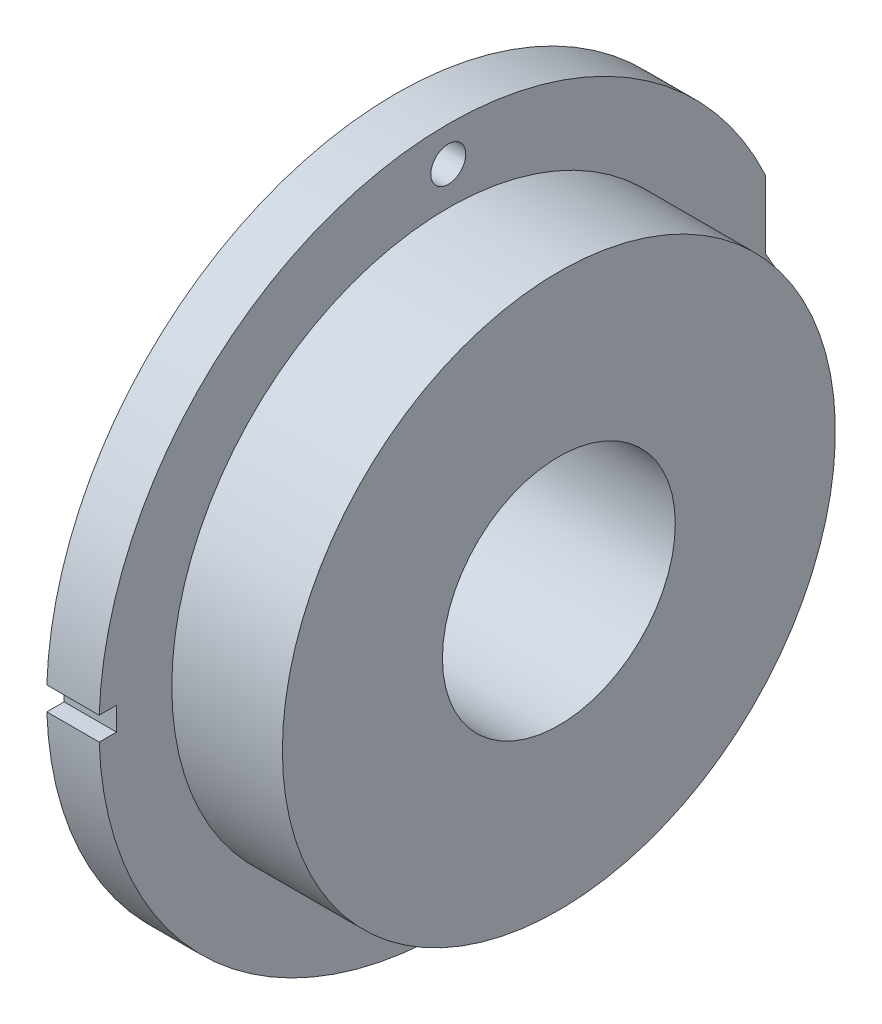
ISO-10303-21;
HEADER;
FILE_DESCRIPTION(('STEP AP214'),'2;1');
FILE_NAME('part.step','',(''),(''),'','','');
FILE_SCHEMA(('AUTOMOTIVE_DESIGN { 1 0 10303 214 1 1 1 1 }'));
ENDSEC;
DATA;
#1=APPLICATION_CONTEXT('core data for automotive mechanical design processes');
#2=APPLICATION_PROTOCOL_DEFINITION('international standard','automotive_design',2000,#1);
#3=PRODUCT_CONTEXT('',#1,'mechanical');
#4=PRODUCT('Part','Part','',(#3));
#5=PRODUCT_RELATED_PRODUCT_CATEGORY('part','',(#4));
#6=PRODUCT_DEFINITION_FORMATION('','',#4);
#7=PRODUCT_DEFINITION_CONTEXT('part definition',#1,'design');
#8=PRODUCT_DEFINITION('design','',#6,#7);
#9=PRODUCT_DEFINITION_SHAPE('','',#8);
#10=(LENGTH_UNIT() NAMED_UNIT(*) SI_UNIT(.MILLI.,.METRE.));
#11=(NAMED_UNIT(*) PLANE_ANGLE_UNIT() SI_UNIT($,.RADIAN.));
#12=(NAMED_UNIT(*) SI_UNIT($,.STERADIAN.) SOLID_ANGLE_UNIT());
#13=UNCERTAINTY_MEASURE_WITH_UNIT(LENGTH_MEASURE(1.E-05),#10,'distance_accuracy_value','');
#14=(GEOMETRIC_REPRESENTATION_CONTEXT(3) GLOBAL_UNCERTAINTY_ASSIGNED_CONTEXT((#13)) GLOBAL_UNIT_ASSIGNED_CONTEXT((#10,
#11,#12)) REPRESENTATION_CONTEXT('',''));
#15=CARTESIAN_POINT('',(0.,0.,0.));
#16=DIRECTION('',(0.,0.,1.));
#17=DIRECTION('',(1.,0.,0.));
#18=AXIS2_PLACEMENT_3D('',#15,#16,#17);
#19=CARTESIAN_POINT('',(-44.2023356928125,0.,0.));
#20=DIRECTION('',(-1.,0.,0.));
#21=DIRECTION('',(0.,0.,1.));
#22=AXIS2_PLACEMENT_3D('',#19,#20,#21);
#23=CYLINDRICAL_SURFACE('',#22,60.);
#24=CARTESIAN_POINT('',(9.,0.,0.));
#25=DIRECTION('',(-1.,0.,0.));
#26=DIRECTION('',(0.,0.,1.));
#27=AXIS2_PLACEMENT_3D('',#24,#25,#26);
#28=CIRCLE('',#27,60.);
#29=CARTESIAN_POINT('',(9.,-25.0948201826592,-54.5));
#30=VERTEX_POINT('',#29);
#31=CARTESIAN_POINT('',(9.,-2.,59.9666574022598));
#32=VERTEX_POINT('',#31);
#33=EDGE_CURVE('E227',#30,#32,#28,.T.);
#34=ORIENTED_EDGE('',*,*,#33,.T.);
#35=DIRECTION('',(-1.,0.,0.));
#36=VECTOR('',#35,1.);
#37=CARTESIAN_POINT('',(-44.2023356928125,-2.,59.9666574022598));
#38=LINE('',#37,#36);
#39=CARTESIAN_POINT('',(0.,-2.,59.9666574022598));
#40=VERTEX_POINT('',#39);
#41=EDGE_CURVE('E137',#32,#40,#38,.T.);
#42=ORIENTED_EDGE('',*,*,#41,.T.);
#43=CARTESIAN_POINT('',(0.,0.,0.));
#44=DIRECTION('',(-1.,0.,0.));
#45=DIRECTION('',(0.,0.,1.));
#46=AXIS2_PLACEMENT_3D('',#43,#44,#45);
#47=CIRCLE('',#46,60.);
#48=CARTESIAN_POINT('',(0.,-25.0948201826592,-54.5));
#49=VERTEX_POINT('',#48);
#50=EDGE_CURVE('E224',#49,#40,#47,.T.);
#51=ORIENTED_EDGE('',*,*,#50,.F.);
#52=DIRECTION('',(-1.,0.,0.));
#53=VECTOR('',#52,1.);
#54=CARTESIAN_POINT('',(28.,-25.0948201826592,-54.5));
#55=LINE('',#54,#53);
#56=EDGE_CURVE('E173',#30,#49,#55,.T.);
#57=ORIENTED_EDGE('',*,*,#56,.F.);
#58=EDGE_LOOP('',(#34,#42,#51,#57));
#59=FACE_BOUND('',#58,.T.);
#60=ADVANCED_FACE('F16',(#59),#23,.T.);
#61=CARTESIAN_POINT('',(-44.2023356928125,0.,0.));
#62=DIRECTION('',(-1.,0.,0.));
#63=DIRECTION('',(0.,0.,1.));
#64=AXIS2_PLACEMENT_3D('',#61,#62,#63);
#65=CYLINDRICAL_SURFACE('',#64,20.);
#66=CARTESIAN_POINT('',(28.,0.,0.));
#67=DIRECTION('',(-1.,0.,0.));
#68=DIRECTION('',(0.,0.,1.));
#69=AXIS2_PLACEMENT_3D('',#66,#67,#68);
#70=CIRCLE('',#69,20.);
#71=CARTESIAN_POINT('',(28.,0.,20.));
#72=VERTEX_POINT('',#71);
#73=EDGE_CURVE('E24',#72,#72,#70,.T.);
#74=ORIENTED_EDGE('',*,*,#73,.F.);
#75=EDGE_LOOP('',(#74));
#76=FACE_BOUND('',#75,.T.);
#77=CARTESIAN_POINT('',(-5.,0.,0.));
#78=DIRECTION('',(-1.,0.,0.));
#79=DIRECTION('',(0.,0.,1.));
#80=AXIS2_PLACEMENT_3D('',#77,#78,#79);
#81=CIRCLE('',#80,20.);
#82=CARTESIAN_POINT('',(-5.,0.,20.));
#83=VERTEX_POINT('',#82);
#84=EDGE_CURVE('E214',#83,#83,#81,.T.);
#85=ORIENTED_EDGE('',*,*,#84,.T.);
#86=EDGE_LOOP('',(#85));
#87=FACE_BOUND('',#86,.T.);
#88=ADVANCED_FACE('F18',(#76,#87),#65,.F.);
#89=CARTESIAN_POINT('',(28.,20.,0.));
#90=DIRECTION('',(-1.,0.,0.));
#91=DIRECTION('',(0.,0.,1.));
#92=AXIS2_PLACEMENT_3D('',#89,#90,#91);
#93=PLANE('',#92);
#94=CARTESIAN_POINT('',(28.,0.,0.));
#95=DIRECTION('',(-1.,0.,0.));
#96=DIRECTION('',(0.,0.,1.));
#97=AXIS2_PLACEMENT_3D('',#94,#95,#96);
#98=CIRCLE('',#97,47.5);
#99=CARTESIAN_POINT('',(28.,0.,47.5));
#100=VERTEX_POINT('',#99);
#101=EDGE_CURVE('E233',#100,#100,#98,.T.);
#102=ORIENTED_EDGE('',*,*,#101,.F.);
#103=EDGE_LOOP('',(#102));
#104=FACE_BOUND('',#103,.T.);
#105=ORIENTED_EDGE('',*,*,#73,.T.);
#106=EDGE_LOOP('',(#105));
#107=FACE_BOUND('',#106,.T.);
#108=ADVANCED_FACE('F238',(#104,#107),#93,.F.);
#109=CARTESIAN_POINT('',(-44.2023356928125,0.,0.));
#110=DIRECTION('',(-1.,0.,0.));
#111=DIRECTION('',(0.,0.,1.));
#112=AXIS2_PLACEMENT_3D('',#109,#110,#111);
#113=CYLINDRICAL_SURFACE('',#112,47.5);
#114=CARTESIAN_POINT('',(9.,0.,0.));
#115=DIRECTION('',(-1.,0.,0.));
#116=DIRECTION('',(0.,0.,1.));
#117=AXIS2_PLACEMENT_3D('',#114,#115,#116);
#118=CIRCLE('',#117,47.5);
#119=CARTESIAN_POINT('',(9.,0.,47.5));
#120=VERTEX_POINT('',#119);
#121=EDGE_CURVE('E230',#120,#120,#118,.T.);
#122=ORIENTED_EDGE('',*,*,#121,.F.);
#123=EDGE_LOOP('',(#122));
#124=FACE_BOUND('',#123,.T.);
#125=ORIENTED_EDGE('',*,*,#101,.T.);
#126=EDGE_LOOP('',(#125));
#127=FACE_BOUND('',#126,.T.);
#128=ADVANCED_FACE('F278',(#124,#127),#113,.T.);
#129=CARTESIAN_POINT('',(9.,47.5,0.));
#130=DIRECTION('',(-1.,0.,0.));
#131=DIRECTION('',(0.,0.,1.));
#132=AXIS2_PLACEMENT_3D('',#129,#130,#131);
#133=PLANE('',#132);
#134=DIRECTION('',(0.,-1.,0.));
#135=VECTOR('',#134,1.);
#136=CARTESIAN_POINT('',(9.,47.5,57.));
#137=LINE('',#136,#135);
#138=CARTESIAN_POINT('',(9.,2.,57.));
#139=VERTEX_POINT('',#138);
#140=CARTESIAN_POINT('',(9.,-2.,57.));
#141=VERTEX_POINT('',#140);
#142=EDGE_CURVE('E119',#139,#141,#137,.T.);
#143=ORIENTED_EDGE('',*,*,#142,.T.);
#144=DIRECTION('',(0.,0.,1.));
#145=VECTOR('',#144,1.);
#146=CARTESIAN_POINT('',(9.,-2.,0.));
#147=LINE('',#146,#145);
#148=EDGE_CURVE('E140',#141,#32,#147,.T.);
#149=ORIENTED_EDGE('',*,*,#148,.T.);
#150=ORIENTED_EDGE('',*,*,#33,.F.);
#151=DIRECTION('',(0.,1.,0.));
#152=VECTOR('',#151,1.);
#153=CARTESIAN_POINT('',(9.,47.5,-54.5));
#154=LINE('',#153,#152);
#155=CARTESIAN_POINT('',(9.,-13.4102540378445,-54.5));
#156=VERTEX_POINT('',#155);
#157=EDGE_CURVE('E196',#30,#156,#154,.T.);
#158=ORIENTED_EDGE('',*,*,#157,.T.);
#159=DIRECTION('',(0.,0.866025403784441,-0.5));
#160=VECTOR('',#159,1.);
#161=CARTESIAN_POINT('',(9.,8.6732442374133,-67.2499136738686));
#162=LINE('',#161,#160);
#163=CARTESIAN_POINT('',(9.,-4.75,-59.5));
#164=VERTEX_POINT('',#163);
#165=EDGE_CURVE('E199',#156,#164,#162,.T.);
#166=ORIENTED_EDGE('',*,*,#165,.T.);
#167=DIRECTION('',(0.,1.,0.));
#168=VECTOR('',#167,1.);
#169=CARTESIAN_POINT('',(9.,47.5,-59.5));
#170=LINE('',#169,#168);
#171=CARTESIAN_POINT('',(9.,-3.75,-59.5));
#172=VERTEX_POINT('',#171);
#173=EDGE_CURVE('E202',#164,#172,#170,.T.);
#174=ORIENTED_EDGE('',*,*,#173,.T.);
#175=DIRECTION('',(0.,0.86602540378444,0.5));
#176=VECTOR('',#175,1.);
#177=CARTESIAN_POINT('',(9.,60.4517557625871,-22.433099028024));
#178=LINE('',#177,#176);
#179=CARTESIAN_POINT('',(9.,0.,-57.3349364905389));
#180=VERTEX_POINT('',#179);
#181=EDGE_CURVE('E205',#172,#180,#178,.T.);
#182=ORIENTED_EDGE('',*,*,#181,.T.);
#183=DIRECTION('',(0.,0.866025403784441,-0.5));
#184=VECTOR('',#183,1.);
#185=CARTESIAN_POINT('',(9.,10.7982442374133,-63.5693057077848));
#186=LINE('',#185,#184);
#187=CARTESIAN_POINT('',(9.,3.75,-59.5));
#188=VERTEX_POINT('',#187);
#189=EDGE_CURVE('E168',#180,#188,#186,.T.);
#190=ORIENTED_EDGE('',*,*,#189,.T.);
#191=DIRECTION('',(0.,1.,0.));
#192=VECTOR('',#191,1.);
#193=CARTESIAN_POINT('',(9.,47.5,-59.5));
#194=LINE('',#193,#192);
#195=CARTESIAN_POINT('',(9.,4.75,-59.5));
#196=VERTEX_POINT('',#195);
#197=EDGE_CURVE('E187',#188,#196,#194,.T.);
#198=ORIENTED_EDGE('',*,*,#197,.T.);
#199=DIRECTION('',(0.,0.866025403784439,0.5));
#200=VECTOR('',#199,1.);
#201=CARTESIAN_POINT('',(9.,62.5767557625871,-26.1137069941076));
#202=LINE('',#201,#200);
#203=CARTESIAN_POINT('',(9.,13.4102540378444,-54.5));
#204=VERTEX_POINT('',#203);
#205=EDGE_CURVE('E190',#196,#204,#202,.T.);
#206=ORIENTED_EDGE('',*,*,#205,.T.);
#207=DIRECTION('',(0.,1.,0.));
#208=VECTOR('',#207,1.);
#209=CARTESIAN_POINT('',(9.,47.5,-54.5));
#210=LINE('',#209,#208);
#211=CARTESIAN_POINT('',(9.,25.0948201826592,-54.5));
#212=VERTEX_POINT('',#211);
#213=EDGE_CURVE('E193',#204,#212,#210,.T.);
#214=ORIENTED_EDGE('',*,*,#213,.T.);
#215=CARTESIAN_POINT('',(9.,2.,59.9666574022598));
#216=VERTEX_POINT('',#215);
#217=EDGE_CURVE('E226',#216,#212,#28,.T.);
#218=ORIENTED_EDGE('',*,*,#217,.F.);
#219=DIRECTION('',(0.,0.,-1.));
#220=VECTOR('',#219,1.);
#221=CARTESIAN_POINT('',(9.,2.,0.));
#222=LINE('',#221,#220);
#223=EDGE_CURVE('E134',#216,#139,#222,.T.);
#224=ORIENTED_EDGE('',*,*,#223,.T.);
#225=EDGE_LOOP('',(#143,#149,#150,#158,#166,#174,#182,#190,#198,#206,#214,#218,#224));
#226=FACE_BOUND('',#225,.T.);
#227=CARTESIAN_POINT('',(9.,54.,0.));
#228=DIRECTION('',(-1.,0.,0.));
#229=DIRECTION('',(0.,0.,1.));
#230=AXIS2_PLACEMENT_3D('',#227,#228,#229);
#231=CIRCLE('',#230,3.);
#232=CARTESIAN_POINT('',(9.,54.,3.));
#233=VERTEX_POINT('',#232);
#234=EDGE_CURVE('E211',#233,#233,#231,.T.);
#235=ORIENTED_EDGE('',*,*,#234,.T.);
#236=EDGE_LOOP('',(#235));
#237=FACE_BOUND('',#236,.T.);
#238=ORIENTED_EDGE('',*,*,#121,.T.);
#239=EDGE_LOOP('',(#238));
#240=FACE_BOUND('',#239,.T.);
#241=ADVANCED_FACE('F266',(#226,#237,#240),#133,.F.);
#242=CARTESIAN_POINT('',(0.,2.,59.9666574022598));
#243=VERTEX_POINT('',#242);
#244=CARTESIAN_POINT('',(0.,25.0948201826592,-54.5));
#245=VERTEX_POINT('',#244);
#246=EDGE_CURVE('E223',#243,#245,#47,.T.);
#247=ORIENTED_EDGE('',*,*,#246,.F.);
#248=DIRECTION('',(-1.,0.,0.));
#249=VECTOR('',#248,1.);
#250=CARTESIAN_POINT('',(-44.2023356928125,2.,59.9666574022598));
#251=LINE('',#250,#249);
#252=EDGE_CURVE('E31',#243,#216,#251,.F.);
#253=ORIENTED_EDGE('',*,*,#252,.T.);
#254=ORIENTED_EDGE('',*,*,#217,.T.);
#255=DIRECTION('',(-1.,0.,0.));
#256=VECTOR('',#255,1.);
#257=CARTESIAN_POINT('',(28.,25.0948201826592,-54.5));
#258=LINE('',#257,#256);
#259=EDGE_CURVE('E175',#212,#245,#258,.T.);
#260=ORIENTED_EDGE('',*,*,#259,.T.);
#261=EDGE_LOOP('',(#247,#253,#254,#260));
#262=FACE_BOUND('',#261,.T.);
#263=ADVANCED_FACE('F258',(#262),#23,.T.);
#264=CARTESIAN_POINT('',(0.,60.,0.));
#265=DIRECTION('',(1.,0.,0.));
#266=DIRECTION('',(0.,0.,-1.));
#267=AXIS2_PLACEMENT_3D('',#264,#265,#266);
#268=PLANE('',#267);
#269=CARTESIAN_POINT('',(0.,54.,0.));
#270=DIRECTION('',(-1.,0.,0.));
#271=DIRECTION('',(0.,0.,1.));
#272=AXIS2_PLACEMENT_3D('',#269,#270,#271);
#273=CIRCLE('',#272,3.);
#274=CARTESIAN_POINT('',(0.,54.,3.));
#275=VERTEX_POINT('',#274);
#276=EDGE_CURVE('E208',#275,#275,#273,.T.);
#277=ORIENTED_EDGE('',*,*,#276,.F.);
#278=EDGE_LOOP('',(#277));
#279=FACE_BOUND('',#278,.T.);
#280=CARTESIAN_POINT('',(0.,0.,0.));
#281=DIRECTION('',(-1.,0.,0.));
#282=DIRECTION('',(0.,0.,1.));
#283=AXIS2_PLACEMENT_3D('',#280,#281,#282);
#284=CIRCLE('',#283,42.);
#285=CARTESIAN_POINT('',(0.,0.,42.));
#286=VERTEX_POINT('',#285);
#287=EDGE_CURVE('E220',#286,#286,#284,.T.);
#288=ORIENTED_EDGE('',*,*,#287,.F.);
#289=EDGE_LOOP('',(#288));
#290=FACE_BOUND('',#289,.T.);
#291=ORIENTED_EDGE('',*,*,#50,.T.);
#292=DIRECTION('',(0.,0.,1.));
#293=VECTOR('',#292,1.);
#294=CARTESIAN_POINT('',(0.,-2.,67.));
#295=LINE('',#294,#293);
#296=CARTESIAN_POINT('',(0.,-2.,57.));
#297=VERTEX_POINT('',#296);
#298=EDGE_CURVE('E122',#297,#40,#295,.T.);
#299=ORIENTED_EDGE('',*,*,#298,.F.);
#300=DIRECTION('',(0.,-1.,0.));
#301=VECTOR('',#300,1.);
#302=CARTESIAN_POINT('',(0.,2.,57.));
#303=LINE('',#302,#301);
#304=CARTESIAN_POINT('',(0.,2.,57.));
#305=VERTEX_POINT('',#304);
#306=EDGE_CURVE('E116',#305,#297,#303,.T.);
#307=ORIENTED_EDGE('',*,*,#306,.F.);
#308=DIRECTION('',(0.,0.,1.));
#309=VECTOR('',#308,1.);
#310=CARTESIAN_POINT('',(0.,2.,0.));
#311=LINE('',#310,#309);
#312=EDGE_CURVE('E11',#305,#243,#311,.T.);
#313=ORIENTED_EDGE('',*,*,#312,.T.);
#314=ORIENTED_EDGE('',*,*,#246,.T.);
#315=DIRECTION('',(0.,1.,0.));
#316=VECTOR('',#315,1.);
#317=CARTESIAN_POINT('',(0.,13.4102540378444,-54.5));
#318=LINE('',#317,#316);
#319=CARTESIAN_POINT('',(0.,13.4102540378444,-54.5));
#320=VERTEX_POINT('',#319);
#321=EDGE_CURVE('E153',#320,#245,#318,.T.);
#322=ORIENTED_EDGE('',*,*,#321,.F.);
#323=DIRECTION('',(0.,0.866025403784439,0.5));
#324=VECTOR('',#323,1.);
#325=CARTESIAN_POINT('',(0.,4.75,-59.5));
#326=LINE('',#325,#324);
#327=CARTESIAN_POINT('',(0.,4.75,-59.5));
#328=VERTEX_POINT('',#327);
#329=EDGE_CURVE('E150',#328,#320,#326,.T.);
#330=ORIENTED_EDGE('',*,*,#329,.F.);
#331=DIRECTION('',(0.,1.,0.));
#332=VECTOR('',#331,1.);
#333=CARTESIAN_POINT('',(0.,3.75,-59.5));
#334=LINE('',#333,#332);
#335=CARTESIAN_POINT('',(0.,3.75,-59.5));
#336=VERTEX_POINT('',#335);
#337=EDGE_CURVE('E147',#336,#328,#334,.T.);
#338=ORIENTED_EDGE('',*,*,#337,.F.);
#339=DIRECTION('',(0.,0.866025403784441,-0.5));
#340=VECTOR('',#339,1.);
#341=CARTESIAN_POINT('',(0.,0.,-57.3349364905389));
#342=LINE('',#341,#340);
#343=CARTESIAN_POINT('',(0.,0.,-57.3349364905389));
#344=VERTEX_POINT('',#343);
#345=EDGE_CURVE('E144',#344,#336,#342,.T.);
#346=ORIENTED_EDGE('',*,*,#345,.F.);
#347=DIRECTION('',(0.,0.86602540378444,0.5));
#348=VECTOR('',#347,1.);
#349=CARTESIAN_POINT('',(0.,0.,-57.3349364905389));
#350=LINE('',#349,#348);
#351=CARTESIAN_POINT('',(0.,-3.75,-59.5));
#352=VERTEX_POINT('',#351);
#353=EDGE_CURVE('E38',#352,#344,#350,.T.);
#354=ORIENTED_EDGE('',*,*,#353,.F.);
#355=DIRECTION('',(0.,1.,0.));
#356=VECTOR('',#355,1.);
#357=CARTESIAN_POINT('',(0.,-3.75,-59.5));
#358=LINE('',#357,#356);
#359=CARTESIAN_POINT('',(0.,-4.75,-59.5));
#360=VERTEX_POINT('',#359);
#361=EDGE_CURVE('E162',#360,#352,#358,.T.);
#362=ORIENTED_EDGE('',*,*,#361,.F.);
#363=DIRECTION('',(0.,0.866025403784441,-0.5));
#364=VECTOR('',#363,1.);
#365=CARTESIAN_POINT('',(0.,-4.75,-59.5));
#366=LINE('',#365,#364);
#367=CARTESIAN_POINT('',(0.,-13.4102540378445,-54.5));
#368=VERTEX_POINT('',#367);
#369=EDGE_CURVE('E159',#368,#360,#366,.T.);
#370=ORIENTED_EDGE('',*,*,#369,.F.);
#371=DIRECTION('',(0.,1.,0.));
#372=VECTOR('',#371,1.);
#373=CARTESIAN_POINT('',(0.,-13.4102540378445,-54.5));
#374=LINE('',#373,#372);
#375=EDGE_CURVE('E156',#49,#368,#374,.T.);
#376=ORIENTED_EDGE('',*,*,#375,.F.);
#377=EDGE_LOOP('',(#291,#299,#307,#313,#314,#322,#330,#338,#346,#354,#362,#370,#376));
#378=FACE_BOUND('',#377,.T.);
#379=ADVANCED_FACE('F128',(#279,#290,#378),#268,.F.);
#380=CARTESIAN_POINT('',(-44.2023356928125,0.,0.));
#381=DIRECTION('',(-1.,0.,0.));
#382=DIRECTION('',(0.,0.,1.));
#383=AXIS2_PLACEMENT_3D('',#380,#381,#382);
#384=CYLINDRICAL_SURFACE('',#383,42.);
#385=CARTESIAN_POINT('',(-5.,0.,0.));
#386=DIRECTION('',(-1.,0.,0.));
#387=DIRECTION('',(0.,0.,1.));
#388=AXIS2_PLACEMENT_3D('',#385,#386,#387);
#389=CIRCLE('',#388,42.);
#390=CARTESIAN_POINT('',(-5.,0.,42.));
#391=VERTEX_POINT('',#390);
#392=EDGE_CURVE('E217',#391,#391,#389,.T.);
#393=ORIENTED_EDGE('',*,*,#392,.F.);
#394=EDGE_LOOP('',(#393));
#395=FACE_BOUND('',#394,.T.);
#396=ORIENTED_EDGE('',*,*,#287,.T.);
#397=EDGE_LOOP('',(#396));
#398=FACE_BOUND('',#397,.T.);
#399=ADVANCED_FACE('F248',(#395,#398),#384,.T.);
#400=CARTESIAN_POINT('',(-5.,20.,0.));
#401=DIRECTION('',(1.,0.,0.));
#402=DIRECTION('',(0.,0.,-1.));
#403=AXIS2_PLACEMENT_3D('',#400,#401,#402);
#404=PLANE('',#403);
#405=ORIENTED_EDGE('',*,*,#84,.F.);
#406=EDGE_LOOP('',(#405));
#407=FACE_BOUND('',#406,.T.);
#408=ORIENTED_EDGE('',*,*,#392,.T.);
#409=EDGE_LOOP('',(#408));
#410=FACE_BOUND('',#409,.T.);
#411=ADVANCED_FACE('F244',(#407,#410),#404,.F.);
#412=CARTESIAN_POINT('',(0.,54.,0.));
#413=DIRECTION('',(-1.,0.,0.));
#414=DIRECTION('',(0.,0.,1.));
#415=AXIS2_PLACEMENT_3D('',#412,#413,#414);
#416=CYLINDRICAL_SURFACE('',#415,3.);
#417=ORIENTED_EDGE('',*,*,#276,.T.);
#418=EDGE_LOOP('',(#417));
#419=FACE_BOUND('',#418,.T.);
#420=ORIENTED_EDGE('',*,*,#234,.F.);
#421=EDGE_LOOP('',(#420));
#422=FACE_BOUND('',#421,.T.);
#423=ADVANCED_FACE('F247',(#419,#422),#416,.F.);
#424=CARTESIAN_POINT('',(28.,0.,-57.3349364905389));
#425=DIRECTION('',(0.,-0.5,0.86602540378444));
#426=DIRECTION('',(0.,-0.86602540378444,-0.5));
#427=AXIS2_PLACEMENT_3D('',#424,#425,#426);
#428=PLANE('',#427);
#429=DIRECTION('',(-1.,0.,0.));
#430=VECTOR('',#429,1.);
#431=CARTESIAN_POINT('',(28.,-3.75,-59.5));
#432=LINE('',#431,#430);
#433=EDGE_CURVE('E166',#172,#352,#432,.T.);
#434=ORIENTED_EDGE('',*,*,#433,.T.);
#435=ORIENTED_EDGE('',*,*,#353,.T.);
#436=DIRECTION('',(-1.,0.,0.));
#437=VECTOR('',#436,1.);
#438=CARTESIAN_POINT('',(28.,0.,-57.3349364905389));
#439=LINE('',#438,#437);
#440=EDGE_CURVE('E165',#180,#344,#439,.T.);
#441=ORIENTED_EDGE('',*,*,#440,.F.);
#442=ORIENTED_EDGE('',*,*,#181,.F.);
#443=EDGE_LOOP('',(#434,#435,#441,#442));
#444=FACE_BOUND('',#443,.T.);
#445=ADVANCED_FACE('F337',(#444),#428,.F.);
#446=CARTESIAN_POINT('',(28.,-3.75,-59.5));
#447=DIRECTION('',(0.,0.,1.));
#448=DIRECTION('',(0.,-1.,0.));
#449=AXIS2_PLACEMENT_3D('',#446,#447,#448);
#450=PLANE('',#449);
#451=DIRECTION('',(-1.,0.,0.));
#452=VECTOR('',#451,1.);
#453=CARTESIAN_POINT('',(28.,-4.75,-59.5));
#454=LINE('',#453,#452);
#455=EDGE_CURVE('E169',#164,#360,#454,.T.);
#456=ORIENTED_EDGE('',*,*,#455,.T.);
#457=ORIENTED_EDGE('',*,*,#361,.T.);
#458=ORIENTED_EDGE('',*,*,#433,.F.);
#459=ORIENTED_EDGE('',*,*,#173,.F.);
#460=EDGE_LOOP('',(#456,#457,#458,#459));
#461=FACE_BOUND('',#460,.T.);
#462=ADVANCED_FACE('F347',(#461),#450,.F.);
#463=CARTESIAN_POINT('',(28.,-4.75,-59.5));
#464=DIRECTION('',(0.,0.5,0.866025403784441));
#465=DIRECTION('',(0.,-0.866025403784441,0.5));
#466=AXIS2_PLACEMENT_3D('',#463,#464,#465);
#467=PLANE('',#466);
#468=DIRECTION('',(-1.,0.,0.));
#469=VECTOR('',#468,1.);
#470=CARTESIAN_POINT('',(28.,-13.4102540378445,-54.5));
#471=LINE('',#470,#469);
#472=EDGE_CURVE('E171',#156,#368,#471,.T.);
#473=ORIENTED_EDGE('',*,*,#472,.T.);
#474=ORIENTED_EDGE('',*,*,#369,.T.);
#475=ORIENTED_EDGE('',*,*,#455,.F.);
#476=ORIENTED_EDGE('',*,*,#165,.F.);
#477=EDGE_LOOP('',(#473,#474,#475,#476));
#478=FACE_BOUND('',#477,.T.);
#479=ADVANCED_FACE('F356',(#478),#467,.F.);
#480=CARTESIAN_POINT('',(28.,-13.4102540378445,-54.5));
#481=DIRECTION('',(0.,0.,1.));
#482=DIRECTION('',(1.,0.,0.));
#483=AXIS2_PLACEMENT_3D('',#480,#481,#482);
#484=PLANE('',#483);
#485=ORIENTED_EDGE('',*,*,#56,.T.);
#486=ORIENTED_EDGE('',*,*,#375,.T.);
#487=ORIENTED_EDGE('',*,*,#472,.F.);
#488=ORIENTED_EDGE('',*,*,#157,.F.);
#489=EDGE_LOOP('',(#485,#486,#487,#488));
#490=FACE_BOUND('',#489,.T.);
#491=ADVANCED_FACE('F366',(#490),#484,.F.);
#492=CARTESIAN_POINT('',(28.,13.4102540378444,-54.5));
#493=DIRECTION('',(0.,0.,1.));
#494=DIRECTION('',(1.,0.,0.));
#495=AXIS2_PLACEMENT_3D('',#492,#493,#494);
#496=PLANE('',#495);
#497=DIRECTION('',(-1.,0.,0.));
#498=VECTOR('',#497,1.);
#499=CARTESIAN_POINT('',(28.,13.4102540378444,-54.5));
#500=LINE('',#499,#498);
#501=EDGE_CURVE('E178',#204,#320,#500,.T.);
#502=ORIENTED_EDGE('',*,*,#501,.T.);
#503=ORIENTED_EDGE('',*,*,#321,.T.);
#504=ORIENTED_EDGE('',*,*,#259,.F.);
#505=ORIENTED_EDGE('',*,*,#213,.F.);
#506=EDGE_LOOP('',(#502,#503,#504,#505));
#507=FACE_BOUND('',#506,.T.);
#508=ADVANCED_FACE('F376',(#507),#496,.F.);
#509=CARTESIAN_POINT('',(28.,4.75,-59.5));
#510=DIRECTION('',(0.,-0.5,0.866025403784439));
#511=DIRECTION('',(0.,-0.866025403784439,-0.5));
#512=AXIS2_PLACEMENT_3D('',#509,#510,#511);
#513=PLANE('',#512);
#514=DIRECTION('',(-1.,0.,0.));
#515=VECTOR('',#514,1.);
#516=CARTESIAN_POINT('',(28.,4.75,-59.5));
#517=LINE('',#516,#515);
#518=EDGE_CURVE('E180',#196,#328,#517,.T.);
#519=ORIENTED_EDGE('',*,*,#518,.T.);
#520=ORIENTED_EDGE('',*,*,#329,.T.);
#521=ORIENTED_EDGE('',*,*,#501,.F.);
#522=ORIENTED_EDGE('',*,*,#205,.F.);
#523=EDGE_LOOP('',(#519,#520,#521,#522));
#524=FACE_BOUND('',#523,.T.);
#525=ADVANCED_FACE('F386',(#524),#513,.F.);
#526=CARTESIAN_POINT('',(28.,3.75,-59.5));
#527=DIRECTION('',(0.,0.,1.));
#528=DIRECTION('',(0.,-1.,0.));
#529=AXIS2_PLACEMENT_3D('',#526,#527,#528);
#530=PLANE('',#529);
#531=DIRECTION('',(-1.,0.,0.));
#532=VECTOR('',#531,1.);
#533=CARTESIAN_POINT('',(28.,3.75,-59.5));
#534=LINE('',#533,#532);
#535=EDGE_CURVE('E182',#188,#336,#534,.T.);
#536=ORIENTED_EDGE('',*,*,#535,.T.);
#537=ORIENTED_EDGE('',*,*,#337,.T.);
#538=ORIENTED_EDGE('',*,*,#518,.F.);
#539=ORIENTED_EDGE('',*,*,#197,.F.);
#540=EDGE_LOOP('',(#536,#537,#538,#539));
#541=FACE_BOUND('',#540,.T.);
#542=ADVANCED_FACE('F396',(#541),#530,.F.);
#543=CARTESIAN_POINT('',(28.,0.,-57.3349364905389));
#544=DIRECTION('',(0.,0.5,0.866025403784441));
#545=DIRECTION('',(0.,-0.866025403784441,0.5));
#546=AXIS2_PLACEMENT_3D('',#543,#544,#545);
#547=PLANE('',#546);
#548=ORIENTED_EDGE('',*,*,#440,.T.);
#549=ORIENTED_EDGE('',*,*,#345,.T.);
#550=ORIENTED_EDGE('',*,*,#535,.F.);
#551=ORIENTED_EDGE('',*,*,#189,.F.);
#552=EDGE_LOOP('',(#548,#549,#550,#551));
#553=FACE_BOUND('',#552,.T.);
#554=ADVANCED_FACE('F406',(#553),#547,.F.);
#555=CARTESIAN_POINT('',(28.,-2.,67.));
#556=DIRECTION('',(0.,-1.,0.));
#557=DIRECTION('',(0.,0.,-1.));
#558=AXIS2_PLACEMENT_3D('',#555,#556,#557);
#559=PLANE('',#558);
#560=DIRECTION('',(-1.,0.,0.));
#561=VECTOR('',#560,1.);
#562=CARTESIAN_POINT('',(28.,-2.,57.));
#563=LINE('',#562,#561);
#564=EDGE_CURVE('E121',#141,#297,#563,.T.);
#565=ORIENTED_EDGE('',*,*,#564,.T.);
#566=ORIENTED_EDGE('',*,*,#298,.T.);
#567=ORIENTED_EDGE('',*,*,#41,.F.);
#568=ORIENTED_EDGE('',*,*,#148,.F.);
#569=EDGE_LOOP('',(#565,#566,#567,#568));
#570=FACE_BOUND('',#569,.T.);
#571=ADVANCED_FACE('F416',(#570),#559,.F.);
#572=CARTESIAN_POINT('',(28.,2.,57.));
#573=DIRECTION('',(0.,0.,-1.));
#574=DIRECTION('',(-1.,0.,0.));
#575=AXIS2_PLACEMENT_3D('',#572,#573,#574);
#576=PLANE('',#575);
#577=DIRECTION('',(-1.,0.,0.));
#578=VECTOR('',#577,1.);
#579=CARTESIAN_POINT('',(28.,2.,57.));
#580=LINE('',#579,#578);
#581=EDGE_CURVE('E112',#139,#305,#580,.T.);
#582=ORIENTED_EDGE('',*,*,#581,.T.);
#583=ORIENTED_EDGE('',*,*,#306,.T.);
#584=ORIENTED_EDGE('',*,*,#564,.F.);
#585=ORIENTED_EDGE('',*,*,#142,.F.);
#586=EDGE_LOOP('',(#582,#583,#584,#585));
#587=FACE_BOUND('',#586,.T.);
#588=ADVANCED_FACE('F113',(#587),#576,.F.);
#589=CARTESIAN_POINT('',(28.,2.,67.));
#590=DIRECTION('',(0.,1.,0.));
#591=DIRECTION('',(0.,0.,1.));
#592=AXIS2_PLACEMENT_3D('',#589,#590,#591);
#593=PLANE('',#592);
#594=ORIENTED_EDGE('',*,*,#252,.F.);
#595=ORIENTED_EDGE('',*,*,#312,.F.);
#596=ORIENTED_EDGE('',*,*,#581,.F.);
#597=ORIENTED_EDGE('',*,*,#223,.F.);
#598=EDGE_LOOP('',(#594,#595,#596,#597));
#599=FACE_BOUND('',#598,.T.);
#600=ADVANCED_FACE('F124',(#599),#593,.F.);
#601=CLOSED_SHELL('',(#60,#88,#108,#128,#241,#263,#379,#399,#411,#423,#445,#462,#479,#491,#508,
#525,#542,#554,#571,#588,#600));
#602=MANIFOLD_SOLID_BREP('B1',#601);
#603=ADVANCED_BREP_SHAPE_REPRESENTATION('',(#18,#602),#14);
#604=SHAPE_DEFINITION_REPRESENTATION(#9,#603);
ENDSEC;
END-ISO-10303-21;
